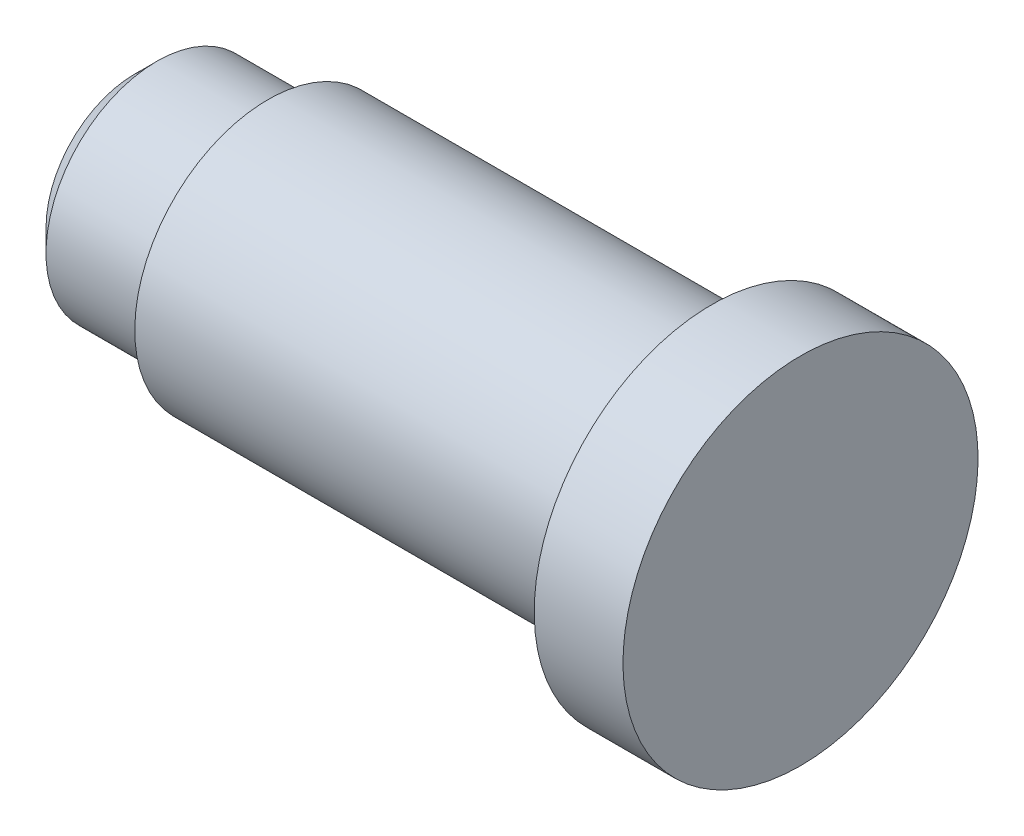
from build123d import *


with BuildPart() as part:
    # Esquisse1 → R_volution1 (revolve)
    with BuildSketch(Plane.XY, mode=Mode.PRIVATE) as r_volution1_sk:
        Polygon((-21.740677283, 0), (-6.740677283, 0), (-6.740677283, 4), (-8.740677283, 4), (-8.740677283, 3), (-18.740677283, 3), (-18.740677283, 2.5), (-21.240677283, 2.5), (-21.740677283, 2), align=None)
    revolve(r_volution1_sk.sketch.rotate(Axis((-21.740677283, 0, 0), (1, 0, 0)), 180), axis=Axis((-21.740677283, 0, 0), (1, 0, 0)))


solid = part.part
